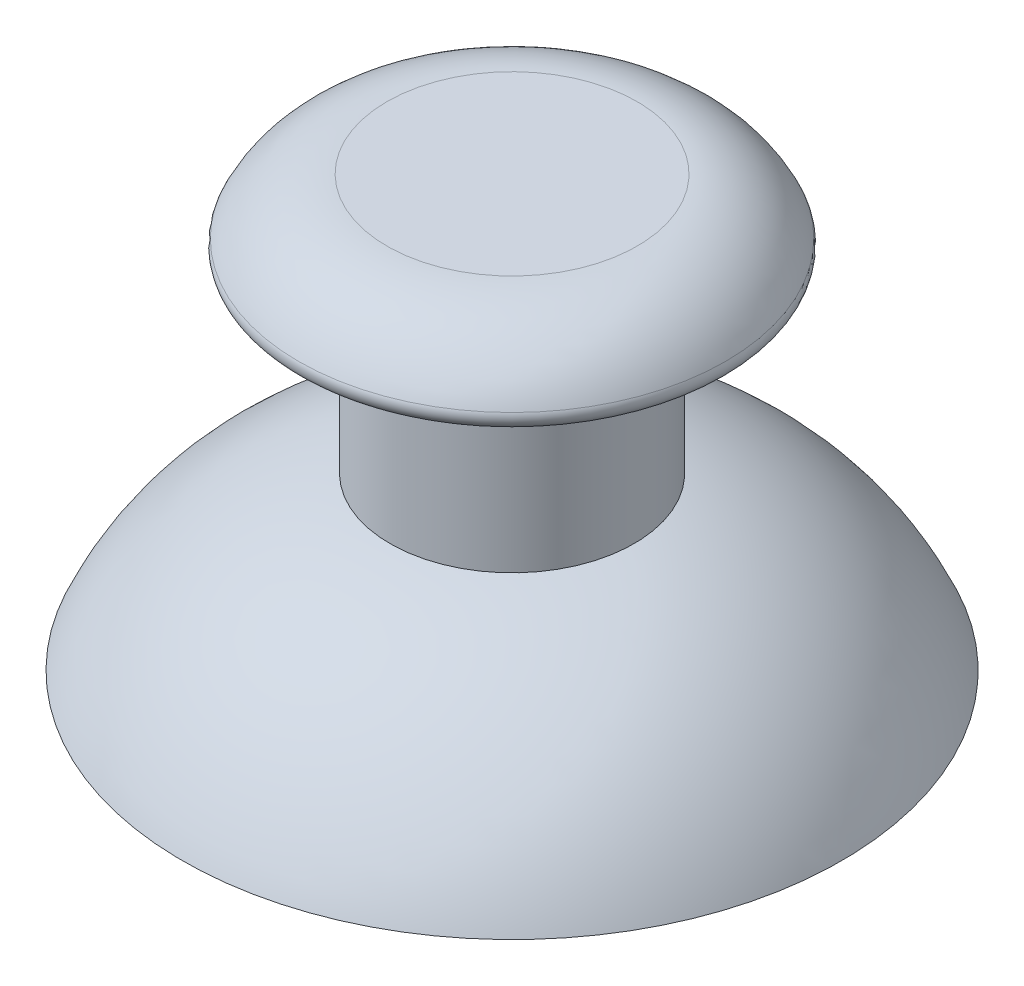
from build123d import *

# Parameters (mm, degrees)
FILLET1_R = 0.5


with BuildPart() as part:
    # Sketch1 → Revolve1 (revolve)
    with BuildSketch(Plane.XY):
        with BuildLine():
            Line((0, 31.617857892), (0, 20.022445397))
            Line((0, 20.022445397), (-4.789317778, 20.022445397))
            ThreePointArc((-4.789317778, 20.022445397), (-9.296235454, 17.896468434), (-12.402618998, 14))
            Line((-12.402618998, 14), (-13.5, 14))
            ThreePointArc((-13.5, 14), (-10.100300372, 18.532507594), (-5, 21))
            Line((-5, 21), (-5, 28.617857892))
            Line((-5, 28.617857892), (-9, 28.617857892))
            ThreePointArc((-9, 28.617857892), (-7.576506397, 30.780135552), (-5.127016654, 31.617857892))
            Line((-5.127016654, 31.617857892), (0, 31.617857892))
        make_face()
    revolve(axis=Axis((0, 31.617857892, 0), (0, -1, 0)))

    # Fillet1
    fillet1_edges = [part.edges().sort_by_distance(p)[0] for p in [
        (9, 28.617857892, 0),
    ]]
    fillet(fillet1_edges, radius=FILLET1_R)


solid = part.part
